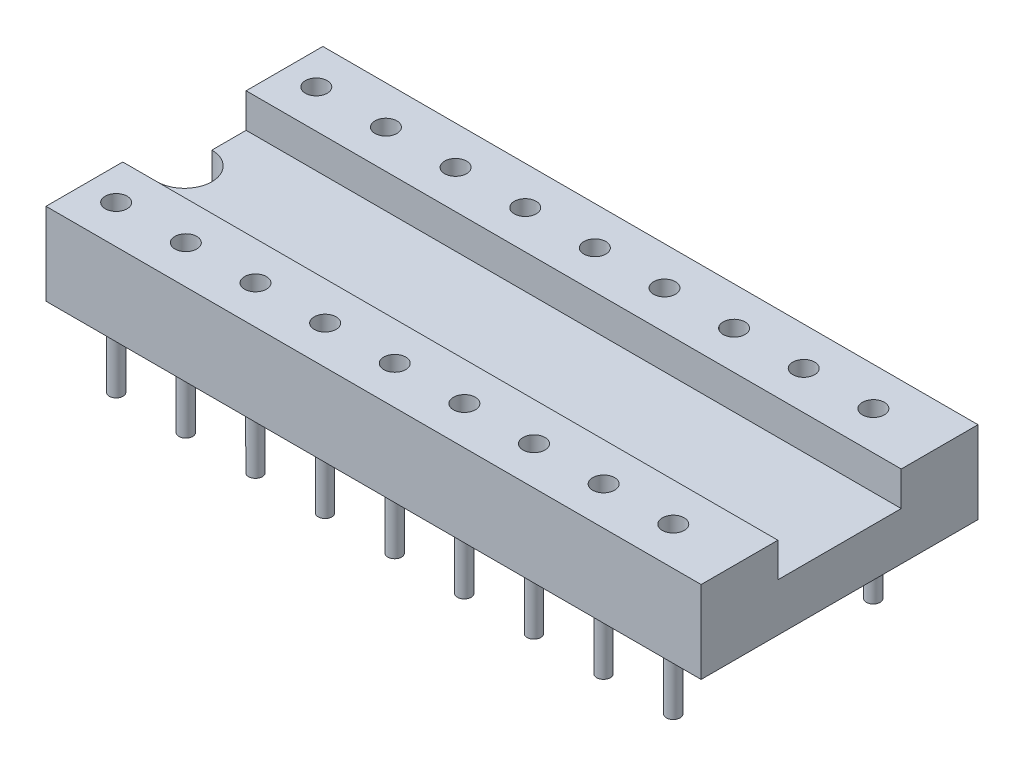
from build123d import *

# Parameters (mm, degrees)
EXTRUSION1_DEPTH        = 23.9
ENL_V_MAT_EXTRU_1_DEPTH = 25.490304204
ESQUISSE3_R             = 0.4
ENL_V_MAT_EXTRU_2_DEPTH = 2.5
ESQUISSE5_R             = 0.25
EXTRUSION2_DEPTH        = 3


with BuildPart() as part:
    # Esquisse1 → Extrusion1 (new body)
    with BuildSketch(Plane(origin=(0, 0, 0), x_dir=(0, 0, -1), z_dir=(1, 0, 0))):
        Polygon((-2.25, 1.75), (-2.25, 3), (-5.05, 3), (-5.05, 0), (5.05, 0), (5.05, 3), (2.25, 3), (2.25, 1.75), align=None)
    extrude(amount=EXTRUSION1_DEPTH)

    # Esquisse2 → Enl_v. mat.-Extru.1 (cut, through all)
    with BuildSketch(Plane(origin=(0, 1.75, 0), x_dir=(-1, 0, 0), z_dir=(0, 1, 0))):
        with BuildLine():
            Line((0, -1), (0, 1))
            ThreePointArc((0, 1), (-1, 0), (0, -1))
        make_face()
    extrude(amount=-ENL_V_MAT_EXTRU_1_DEPTH, mode=Mode.SUBTRACT)

    # Esquisse3 → Enl_v. mat.-Extru.2 (cut)
    with BuildSketch(Plane(origin=(0, 3, 0), x_dir=(-1, 0, 0), z_dir=(0, 1, 0))):
        with Locations(Location((-1.16, 3.65, 0), (0, 0, 90))):
            Circle(ESQUISSE3_R)
        with Locations(Location((-1.16, -3.65, 0), (0, 0, 270))):
            Circle(ESQUISSE3_R)
        with Locations(Location((-3.701, 3.65, 0), (0, 0, 90))):
            Circle(ESQUISSE3_R)
        with Locations(Location((-3.701, -3.65, 0), (0, 0, 270))):
            Circle(ESQUISSE3_R)
        with Locations(Location((-6.242, 3.65, 0), (0, 0, 90))):
            Circle(ESQUISSE3_R)
        with Locations(Location((-6.242, -3.65, 0), (0, 0, 270))):
            Circle(ESQUISSE3_R)
        with Locations(Location((-8.783, 3.65, 0), (0, 0, 90))):
            Circle(ESQUISSE3_R)
        with Locations(Location((-8.783, -3.65, 0), (0, 0, 270))):
            Circle(ESQUISSE3_R)
        with Locations(Location((-11.323, 3.65, 0), (0, 0, 90))):
            Circle(ESQUISSE3_R)
        with Locations(Location((-11.323, -3.65, 0), (0, 0, 270))):
            Circle(ESQUISSE3_R)
        with Locations(Location((-13.863, 3.65, 0), (0, 0, 90))):
            Circle(ESQUISSE3_R)
        with Locations(Location((-13.863, -3.65, 0), (0, 0, 270))):
            Circle(ESQUISSE3_R)
        with Locations(Location((-16.403, 3.65, 0), (0, 0, 90))):
            Circle(ESQUISSE3_R)
        with Locations(Location((-16.403, -3.65, 0), (0, 0, 270))):
            Circle(ESQUISSE3_R)
        with Locations(Location((-18.943, 3.65, 0), (0, 0, 90))):
            Circle(ESQUISSE3_R)
        with Locations(Location((-18.943, -3.65, 0), (0, 0, 270))):
            Circle(ESQUISSE3_R)
        with Locations(Location((-21.483, 3.65, 0), (0, 0, 90))):
            Circle(ESQUISSE3_R)
        with Locations(Location((-21.483, -3.65, 0), (0, 0, 270))):
            Circle(ESQUISSE3_R)
    extrude(amount=-ENL_V_MAT_EXTRU_2_DEPTH, mode=Mode.SUBTRACT)

    # Esquisse5 → Extrusion2 (add)
    with BuildSketch(Plane.XZ):
        with Locations(Location((1.16, 3.65, 0), (0, 0, 90))):
            Circle(ESQUISSE5_R)
        with Locations(Location((1.16, -3.65, 0), (0, 0, 90))):
            Circle(ESQUISSE5_R)
        with Locations(Location((3.7, -3.65, 0), (0, 0, 90))):
            Circle(ESQUISSE5_R)
        with Locations(Location((3.7, 3.65, 0), (0, 0, 90))):
            Circle(ESQUISSE5_R)
        with Locations(Location((6.24, -3.65, 0), (0, 0, 90))):
            Circle(ESQUISSE5_R)
        with Locations(Location((6.24, 3.65, 0), (0, 0, 90))):
            Circle(ESQUISSE5_R)
        with Locations(Location((8.78, -3.65, 0), (0, 0, 90))):
            Circle(ESQUISSE5_R)
        with Locations(Location((8.78, 3.65, 0), (0, 0, 90))):
            Circle(ESQUISSE5_R)
        with Locations(Location((11.32, -3.65, 0), (0, 0, 90))):
            Circle(ESQUISSE5_R)
        with Locations(Location((11.32, 3.65, 0), (0, 0, 90))):
            Circle(ESQUISSE5_R)
        with Locations(Location((13.86, -3.65, 0), (0, 0, 90))):
            Circle(ESQUISSE5_R)
        with Locations(Location((13.86, 3.65, 0), (0, 0, 90))):
            Circle(ESQUISSE5_R)
        with Locations(Location((16.4, -3.65, 0), (0, 0, 90))):
            Circle(ESQUISSE5_R)
        with Locations(Location((16.4, 3.65, 0), (0, 0, 90))):
            Circle(ESQUISSE5_R)
        with Locations(Location((18.94, -3.65, 0), (0, 0, 90))):
            Circle(ESQUISSE5_R)
        with Locations(Location((18.94, 3.65, 0), (0, 0, 90))):
            Circle(ESQUISSE5_R)
        with Locations(Location((21.48, 3.65, 0), (0, 0, 90))):
            Circle(ESQUISSE5_R)
        with Locations(Location((21.48, -3.65, 0), (0, 0, 90))):
            Circle(ESQUISSE5_R)
    extrude(amount=EXTRUSION2_DEPTH)


solid = part.part
